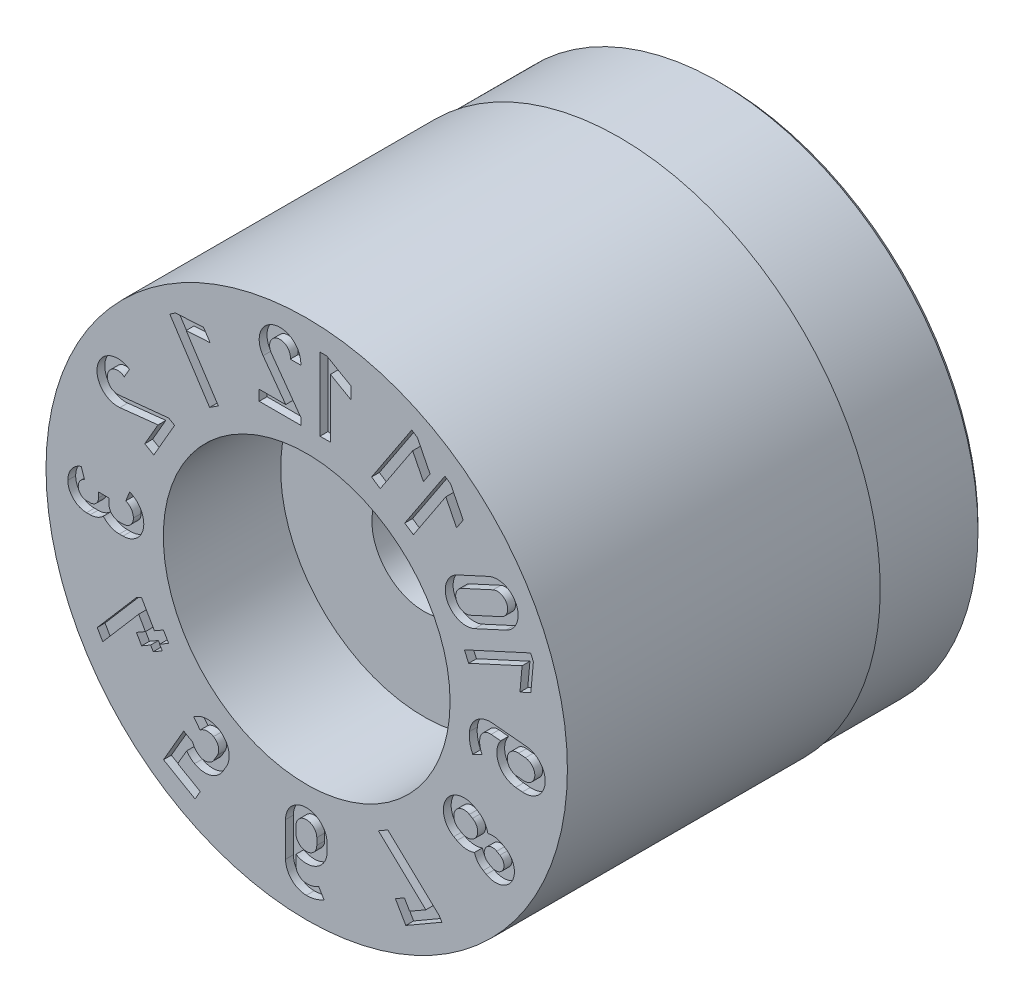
from build123d import *

# Parameters (mm, degrees)
SKETCH4_W          = 4
SKETCH4_H          = 1
CUT_EXTRUDE1_DEPTH = 0.3


with BuildPart() as part:
    # Sketch1 → Revolve1 (revolve)
    with BuildSketch(Plane(origin=(0, 0, 0), x_dir=(0, 0, -1), z_dir=(1, 0, 0)), mode=Mode.PRIVATE) as revolve1_sk:
        Polygon((0, 10), (0, 5.5), (4.5, 5.5), (4.5, 2), (16, 2), (16, 9.75), (15.75, 10), align=None)
    revolve(revolve1_sk.sketch.rotate(Axis((0, 0, 3.797909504), (0, 0, -1)), 90), axis=Axis((0, 0, 3.797909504), (0, 0, -1)))

    # Sketch4 → Cut-Revolve1 (revolve, cut)
    with BuildSketch(Plane(origin=(0, 0, 0), x_dir=(0, 0, -1), z_dir=(1, 0, 0)), mode=Mode.PRIVATE) as cut_revolve1_sk:
        with Locations((14, 10.435)):
            Rectangle(SKETCH4_W, SKETCH4_H)
    revolve(cut_revolve1_sk.sketch.rotate(Axis((0, 0, 0), (0, 0, -1)), 90), axis=Axis((0, 0, 0), (0, 0, -1)), mode=Mode.SUBTRACT)

    # Sketch2 → Cut-Extrude1 (cut)
    # profile 1 of 15: a face of its own
    with BuildSketch(Plane.XY):
        Polygon((5.300084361, 7.396542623), (5.51929573, 7.251659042), (6.002715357, 6.287878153), (5.748876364, 5.903815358), (5.335888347, 6.726863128), (4.092391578, 4.845430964), (3.759425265, 5.065498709), align=None)
    # profile 2 of 15: a face of its own
    with BuildSketch(Plane.XY):
        Polygon((4.028978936, 8.293092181), (4.248190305, 8.148208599), (4.731609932, 7.184427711), (4.477770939, 6.800364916), (4.064782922, 7.623412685), (2.821286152, 5.741980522), (2.48831984, 5.962048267), align=None)
    # profile 3 of 15: a face of its own
    with BuildSketch(Plane.XY):
        with BuildLine():
            Line((8.424546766, -0.018031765), (7.11296297, 0.104130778))
            ThreePointArc((7.11296297, 0.104130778), (6.529221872, -0.076253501), (6.243876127, -0.616503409))
            ThreePointArc((6.243876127, -0.616503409), (6.258822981, -0.971588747), (6.368225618, -1.309730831))
            Line((6.368225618, -1.309730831), (6.728637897, -1.136477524))
            ThreePointArc((6.728637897, -1.136477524), (6.644194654, -0.886813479), (6.645341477, -0.623258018))
            ThreePointArc((6.645341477, -0.623258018), (6.795899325, -0.373893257), (7.075810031, -0.293267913))
            Line((7.075810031, -0.293267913), (7.440612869, -0.327342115))
            ThreePointArc((7.440612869, -0.327342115), (7.364719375, -1.123299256), (8.017779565, -1.584623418))
            Line((8.017779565, -1.584623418), (8.27565765, -1.607788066))
            ThreePointArc((8.27565765, -1.607788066), (9.144980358, -0.887354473), (8.424546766, -0.018031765))
        make_face()
        with BuildLine():
            Line((8.387444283, -0.415647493), (8.129155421, -0.391545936))
            ThreePointArc((8.129155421, -0.391545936), (7.694618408, -0.751921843), (8.055009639, -1.186446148))
            Line((8.055009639, -1.186446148), (8.313242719, -1.210542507))
            ThreePointArc((8.313242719, -1.210542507), (8.747791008, -0.850195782), (8.387444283, -0.415647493))
        make_face(mode=Mode.SUBTRACT)
    # profile 4 of 15: a face of its own
    with BuildSketch(Plane.XY):
        Polygon((2.75059444, -5.659506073), (3.111438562, -5.451172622), (5.088935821, -7.314691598), (5.184720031, -7.480594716), (3.80193593, -8.27894549), (3.402760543, -7.587553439), (3.748504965, -7.387937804), (3.948064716, -7.733585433), (4.570249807, -7.374366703), align=None)
    # profile 5 of 15: a face of its own
    with BuildSketch(Plane.XY):
        with BuildLine():
            Line((6.560339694, -3.095767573), (6.439452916, -3.025844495))
            ThreePointArc((6.439452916, -3.025844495), (5.348331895, -3.317741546), (5.641102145, -4.408628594))
            Line((5.641102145, -4.408628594), (5.762004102, -4.478431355))
            ThreePointArc((5.762004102, -4.478431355), (6.092702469, -4.582476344), (6.436321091, -4.536508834))
            ThreePointArc((6.436321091, -4.536508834), (6.560569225, -4.785262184), (6.769867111, -4.968320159))
            Line((6.769867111, -4.968320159), (6.890890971, -5.038077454))
            ThreePointArc((6.890890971, -5.038077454), (7.872120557, -4.775101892), (7.609144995, -3.793872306))
            Line((7.609144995, -3.793872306), (7.488416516, -3.723653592))
            ThreePointArc((7.488416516, -3.723653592), (7.225367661, -3.633410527), (6.947806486, -3.650682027))
            ThreePointArc((6.947806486, -3.650682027), (6.815784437, -3.3301351), (6.560339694, -3.095767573))
        make_face()
        with BuildLine():
            Line((6.969410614, -4.622664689), (7.090432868, -4.692407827))
            ThreePointArc((7.090432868, -4.692407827), (7.526629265, -4.575529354), (7.409750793, -4.139332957))
            Line((7.409750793, -4.139332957), (7.288840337, -4.06939618))
            ThreePointArc((7.288840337, -4.06939618), (6.852048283, -4.186059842), (6.969410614, -4.622664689))
        make_face(mode=Mode.SUBTRACT)
        with BuildLine():
            Line((5.840596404, -4.062961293), (5.96167785, -4.132867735))
            ThreePointArc((5.96167785, -4.132867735), (6.50686853, -3.986717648), (6.360718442, -3.441526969))
            Line((6.360718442, -3.441526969), (6.239827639, -3.37147251))
            ThreePointArc((6.239827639, -3.37147251), (5.694613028, -3.517685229), (5.840596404, -4.062961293))
        make_face(mode=Mode.SUBTRACT)
    # profile 6 of 15: a face of its own
    with BuildSketch(Plane.XY):
        Polygon((8.586226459, 3.166201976), (8.695897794, 2.927419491), (8.59758916, 1.853686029), (8.179237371, 1.661539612), (8.263056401, 2.578568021), (6.213650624, 1.637288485), (6.047067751, 1.999981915), align=None)
    # profile 7 of 15: a face of its own
    with BuildSketch(Plane.XY):
        with BuildLine():
            Line((6.978122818, 4.904940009), (5.78109122, 4.355150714))
            ThreePointArc((5.78109122, 4.355150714), (5.388738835, 3.296309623), (6.447579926, 2.903957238))
            Line((6.447579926, 2.903957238), (7.644640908, 3.453760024))
            ThreePointArc((7.644640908, 3.453760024), (8.036971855, 4.512609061), (6.978122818, 4.904940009))
        make_face()
        with BuildLine():
            Line((6.280990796, 3.266770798), (7.478051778, 3.816573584))
            ThreePointArc((7.478051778, 3.816573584), (7.674167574, 4.345999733), (7.144752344, 4.542145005))
            Line((7.144752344, 4.542145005), (5.947706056, 3.992348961))
            ThreePointArc((5.947706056, 3.992348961), (5.751546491, 3.462911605), (6.280990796, 3.266770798))
        make_face(mode=Mode.SUBTRACT)
    # profile 8 of 15: a face of its own
    with BuildSketch(Plane.XY):
        Polygon((0.510988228, 9.122664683), (0.773752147, 9.122664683), (1.708458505, 8.585177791), (1.708458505, 8.124810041), (0.910107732, 8.583724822), (0.910107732, 6.32849286), (0.510988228, 6.32849286), align=None)
    # profile 9 of 15: a face of its own
    with BuildSketch(Plane.XY):
        with BuildLine():
            Line((-1.822797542, 6.322371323), (-0.226095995, 6.322371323))
            Line((-0.226095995, 6.322371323), (-0.226095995, 6.586364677))
            Line((-0.226095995, 6.586364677), (-1.3485707, 8.144730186))
            ThreePointArc((-1.3485707, 8.144730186), (-1.118246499, 8.766254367), (-0.62979794, 8.318192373))
            Line((-0.62979794, 8.318192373), (-0.228313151, 8.318182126))
            ThreePointArc((-0.228313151, 8.318182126), (-1.241422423, 9.146395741), (-1.672998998, 7.911053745))
            Line((-1.672998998, 7.911053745), (-0.804824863, 6.721602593))
            Line((-0.804824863, 6.721602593), (-1.822797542, 6.721602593))
            Line((-1.822797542, 6.721602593), (-1.822797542, 6.322371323))
        make_face()
    # profile 10 of 15: a face of its own
    with BuildSketch(Plane.XY):
        Polygon((-5.253152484, 7.505191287), (-5.033295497, 7.649093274), (-3.956864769, 7.711262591), (-3.70474555, 7.32606866), (-4.62405649, 7.272832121), (-3.388984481, 5.385858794), (-3.722931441, 5.167282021), align=None)
    # profile 11 of 15: a face of its own
    with BuildSketch(Plane.XY):
        with BuildLine():
            Line((0.785582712, -7.069475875), (0.786477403, -7.32839074))
            ThreePointArc((0.786477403, -7.32839074), (0.387823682, -8.021487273), (-0.411741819, -8.019873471))
            Line((-0.411741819, -8.019873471), (-0.411775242, -8.386264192))
            ThreePointArc((-0.411775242, -8.386264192), (-0.305492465, -8.657473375), (-0.043218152, -8.784211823))
            ThreePointArc((-0.043218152, -8.784211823), (0.219283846, -8.760870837), (0.460006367, -8.653610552))
            Line((0.460006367, -8.653610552), (0.666044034, -8.996396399))
            ThreePointArc((0.666044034, -8.996396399), (0.339529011, -9.136742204), (-0.012631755, -9.184614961))
            ThreePointArc((-0.012631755, -9.184614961), (-0.57705601, -8.950697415), (-0.810894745, -8.386240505))
            Line((-0.810894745, -8.386240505), (-0.811117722, -7.068930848))
            ThreePointArc((-0.811117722, -7.068930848), (-0.012494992, -6.270853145), (0.785582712, -7.069475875))
        make_face()
        with BuildLine():
            Line((-0.411775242, -7.068979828), (-0.411775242, -7.32839074))
            ThreePointArc((-0.411775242, -7.32839074), (-0.012585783, -7.727566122), (0.386575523, -7.328362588))
            Line((0.386575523, -7.328362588), (0.386575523, -7.069007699))
            ThreePointArc((0.386575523, -7.069007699), (-0.012585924, -6.669818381), (-0.411775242, -7.068979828))
        make_face(mode=Mode.SUBTRACT)
    # profile 12 of 15: a face of its own
    with BuildSketch(Plane.XY):
        with BuildLine():
            Line((-4.605966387, -6.683515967), (-4.946967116, -7.274146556))
            Line((-4.946967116, -7.274146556), (-4.082706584, -7.773127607))
            Line((-4.082706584, -7.773127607), (-4.282332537, -8.1188899))
            Line((-4.282332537, -8.1188899), (-5.492244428, -7.420346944))
            Line((-5.492244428, -7.420346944), (-4.717476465, -6.078409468))
            Line((-4.717476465, -6.078409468), (-4.371828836, -6.27796922))
            ThreePointArc((-4.371828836, -6.27796922), (-4.267651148, -6.468604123), (-4.10235723, -6.609574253))
            ThreePointArc((-4.10235723, -6.609574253), (-3.799474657, -6.64947331), (-3.55716901, -6.463414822))
            Line((-3.55716901, -6.463414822), (-3.427348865, -6.238783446))
            ThreePointArc((-3.427348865, -6.238783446), (-3.387413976, -5.935864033), (-3.573494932, -5.693523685))
            ThreePointArc((-3.573494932, -5.693523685), (-3.836905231, -5.633367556), (-4.08857138, -5.731693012))
            Line((-4.08857138, -5.731693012), (-4.337088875, -5.418888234))
            ThreePointArc((-4.337088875, -5.418888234), (-3.866467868, -5.234877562), (-3.373920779, -5.347755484))
            ThreePointArc((-3.373920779, -5.347755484), (-3.00215969, -5.832590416), (-3.081704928, -6.438349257))
            Line((-3.081704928, -6.438349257), (-3.211661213, -6.662769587))
            ThreePointArc((-3.211661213, -6.662769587), (-3.696407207, -7.034311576), (-4.302013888, -6.955174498))
            ThreePointArc((-4.302013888, -6.955174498), (-4.468130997, -6.835167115), (-4.605966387, -6.683515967))
        make_face()
    # profile 13 of 15: a face of its own
    with BuildSketch(Plane.XY):
        with BuildLine():
            Line((-7.047241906, -0.369982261), (-7.186954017, -0.369982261))
            ThreePointArc((-7.186954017, -0.369982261), (-7.469140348, -0.253097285), (-7.586025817, 0.029088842))
            Line((-7.586025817, 0.029088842), (-7.586025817, 0.228641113))
            Line((-7.586025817, 0.228641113), (-7.985257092, 0.228641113))
            Line((-7.985257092, 0.228641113), (-7.985257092, 0.029137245))
            ThreePointArc((-7.985257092, 0.029137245), (-8.078783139, -0.196654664), (-8.304575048, -0.290180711))
            Line((-8.304575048, -0.290180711), (-8.444267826, -0.290180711))
            ThreePointArc((-8.444267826, -0.290180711), (-8.669980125, -0.196575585), (-8.763601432, 0.029130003))
            ThreePointArc((-8.763601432, 0.029130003), (-8.696321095, 0.238637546), (-8.519389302, 0.369462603))
            Line((-8.519389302, 0.369462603), (-8.647140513, 0.747686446))
            ThreePointArc((-8.647140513, 0.747686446), (-9.020489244, 0.4713499), (-9.162785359, 0.029192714))
            ThreePointArc((-9.162785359, 0.029192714), (-8.952374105, -0.478967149), (-8.444228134, -0.689411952))
            Line((-8.444228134, -0.689411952), (-8.304575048, -0.689411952))
            ThreePointArc((-8.304575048, -0.689411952), (-8.031858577, -0.635619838), (-7.799993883, -0.482301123))
            ThreePointArc((-7.799993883, -0.482301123), (-7.525392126, -0.693975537), (-7.186937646, -0.769213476))
            Line((-7.186937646, -0.769213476), (-7.04717437, -0.769213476))
            ThreePointArc((-7.04717437, -0.769213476), (-6.482711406, -0.535382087), (-6.248958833, 0.02911352))
            ThreePointArc((-6.248958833, 0.02911352), (-6.397689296, 0.511936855), (-6.792232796, 0.827491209))
            Line((-6.792232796, 0.827491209), (-6.938694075, 0.456270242))
            ThreePointArc((-6.938694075, 0.456270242), (-6.72762271, 0.287475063), (-6.64807823, 0.029181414))
            ThreePointArc((-6.64807823, 0.029181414), (-6.764990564, -0.253069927), (-7.047241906, -0.369982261))
        make_face()
    # profile 14 of 15: a face of its own
    with BuildSketch(Plane.XY):
        Polygon((-8.035322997, -4.299822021), (-7.823915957, -4.665989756), (-6.444755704, -3.063123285), (-6.186183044, -3.510984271), (-6.531830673, -3.710544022), (-6.332270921, -4.056191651), (-5.986623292, -3.8566319), (-5.886815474, -4.029504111), (-5.541167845, -3.829944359), (-5.640975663, -3.657072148), (-5.295231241, -3.457456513), (-5.494790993, -3.111808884), (-5.840535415, -3.311424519), (-6.339518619, -2.447160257), (-6.541622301, -2.563844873), align=None)
    # profile 15 of 15: a face of its own
    with BuildSketch(Plane.XY):
        with BuildLine():
            Line((-6.211496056, 2.715736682), (-5.865751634, 2.516121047))
            Line((-5.865751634, 2.516121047), (-5.067400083, 3.898906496))
            Line((-5.067400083, 3.898906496), (-5.296020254, 4.030900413))
            Line((-5.296020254, 4.030900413), (-7.206841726, 3.837991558))
            ThreePointArc((-7.206841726, 3.837991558), (-7.62991523, 4.348196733), (-6.997686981, 4.547163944))
            Line((-6.997686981, 4.547163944), (-6.796944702, 4.894878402))
            ThreePointArc((-6.796944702, 4.894878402), (-8.020731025, 4.431603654), (-7.166691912, 3.440193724))
            Line((-7.166691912, 3.440193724), (-5.702509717, 3.597326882))
            Line((-5.702509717, 3.597326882), (-6.211496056, 2.715736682))
        make_face()
    extrude(amount=-CUT_EXTRUDE1_DEPTH, mode=Mode.SUBTRACT)


solid = part.part
